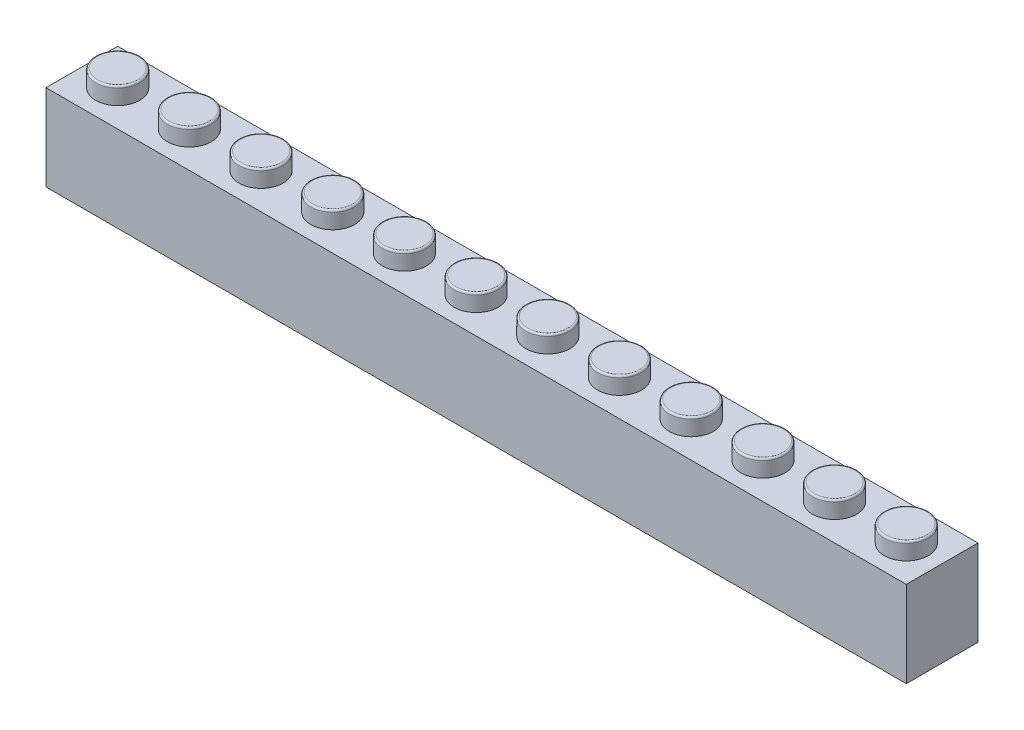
from build123d import *

# Parameters (mm, degrees)
SKIZZE1_W                         = 96
SKIZZE1_H                         = 9.6
LINEAR_AUSTRAGEN1_DEPTH           = 8
SKIZZE2_R                         = 2.456185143
LINEAR_AUSTRAGEN2_DEPTH           = 1.9
VERRUNDUNG1_R                     = 0.2
SKIZZE3_W                         = 92.8
SKIZZE3_H                         = 4.8
SCHNITT_LINEAR_AUSTRAGEN1_DEPTH   = 8.5
SKIZZE4_R                         = 1.6
SCHNITT_LINEAR_AUSTRAGEN2_DEPTH   = 1.8
LINEARES_MUSTER2_COUNT            = 12
LINEARES_MUSTER2_PITCH            = 8
VERRUNDUNG1_OF_LINEARES_MUSTER2_R = 0.2
SKIZZE5_R                         = 1.6
LINEAR_AUSTRAGEN3_DEPTH           = 8.4
LINEARES_MUSTER4_COUNT            = 11
LINEARES_MUSTER4_PITCH            = 8


with BuildPart() as part:
    # Skizze1 → Linear austragen1 (new body)
    with BuildSketch(Plane.XY):
        with Locations((48, 4.8)):
            Rectangle(SKIZZE1_W, SKIZZE1_H)
    extrude(amount=LINEAR_AUSTRAGEN1_DEPTH)

    # Skizze2 → Linear austragen2 (add)
    with BuildSketch(Plane(origin=(0, 9.6, 0), x_dir=(-1, 0, 0), z_dir=(0, 1, 0))):
        with Locations(Location((-4, 4, 0), (0, 0, 270))):
            Circle(SKIZZE2_R)
    linear_austragen2 = extrude(amount=LINEAR_AUSTRAGEN2_DEPTH)

    # Verrundung1
    verrundung1_edges = [part.edges().sort_by_distance(p)[0] for p in [
        (4, 11.5, 6.456185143),
    ]]
    fillet(verrundung1_edges, radius=VERRUNDUNG1_R)

    # Skizze3 → Schnitt-Linear austragen1 (cut)
    with BuildSketch(Plane.XZ):
        with Locations((48, 4)):
            Rectangle(SKIZZE3_W, SKIZZE3_H)
    extrude(amount=-SCHNITT_LINEAR_AUSTRAGEN1_DEPTH, mode=Mode.SUBTRACT)

    # Skizze4 → Schnitt-Linear austragen2 (cut)
    with BuildSketch(Plane.XZ.offset(-8.5)):
        with Locations(Location((4, 4, 0), (0, 0, 270))):
            Circle(SKIZZE4_R)
    schnitt_linear_austragen2 = extrude(amount=-SCHNITT_LINEAR_AUSTRAGEN2_DEPTH, mode=Mode.SUBTRACT)

    # Lineares Muster2: Linear austragen2, Schnitt-Linear austragen2 ×12
    with Locations(*[(i * LINEARES_MUSTER2_PITCH, 0, 0) for i in range(1, LINEARES_MUSTER2_COUNT)]):
        add(linear_austragen2)
        add(schnitt_linear_austragen2, mode=Mode.SUBTRACT)

    # Verrundung1 of Lineares Muster2
    verrundung1_of_lineares_muster2_edges = [part.edges().sort_by_distance(p)[0] for p in [
        (12, 11.5, 6.456185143),
        (20, 11.5, 6.456185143),
        (28, 11.5, 6.456185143),
        (36, 11.5, 6.456185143),
        (44, 11.5, 6.456185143),
        (52, 11.5, 6.456185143),
        (60, 11.5, 6.456185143),
        (68, 11.5, 6.456185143),
        (76, 11.5, 6.456185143),
        (84, 11.5, 6.456185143),
        (92, 11.5, 6.456185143),
    ]]
    fillet(verrundung1_of_lineares_muster2_edges, radius=VERRUNDUNG1_OF_LINEARES_MUSTER2_R)

    # Skizze5 → Linear austragen3 (add)
    with BuildSketch(Plane.XZ.offset(-8.5)):
        with Locations(Location((8, 4, 0), (0, 0, 270))):
            Circle(SKIZZE5_R)
    linear_austragen3 = extrude(amount=LINEAR_AUSTRAGEN3_DEPTH)

    # Lineares Muster4: Linear austragen3 ×11
    with Locations(*[(i * LINEARES_MUSTER4_PITCH, 0, 0) for i in range(1, LINEARES_MUSTER4_COUNT)]):
        add(linear_austragen3)


solid = part.part
